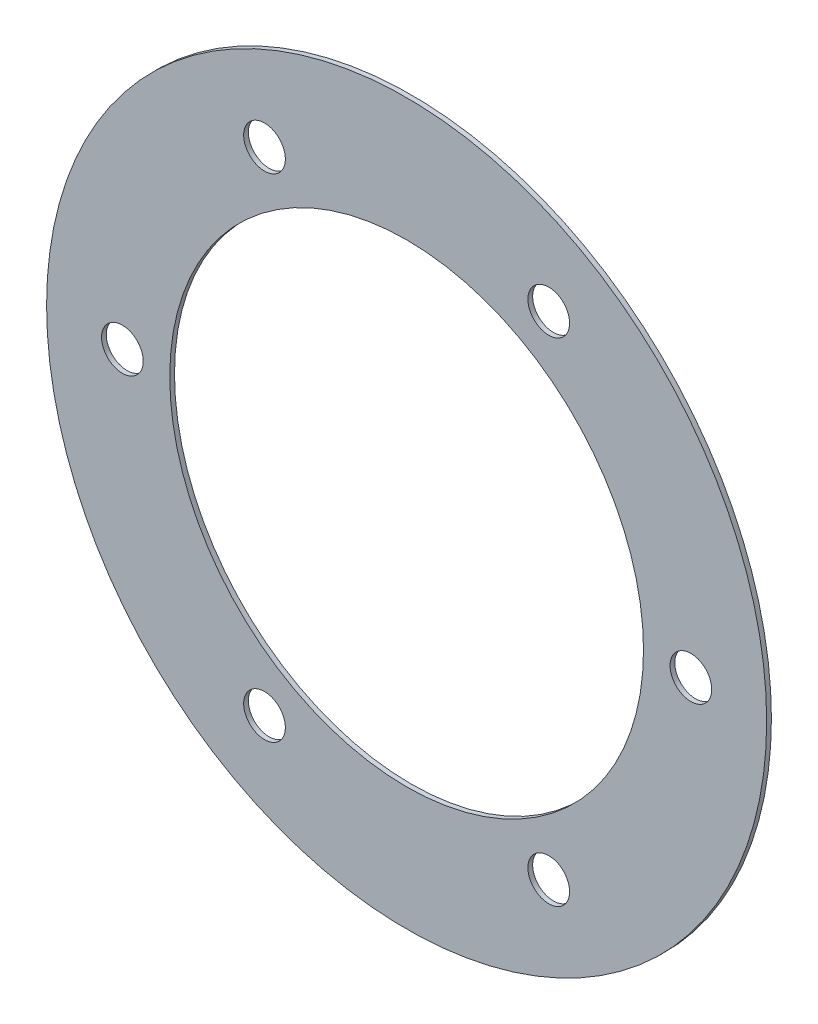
ISO-10303-21;
HEADER;
FILE_DESCRIPTION(('STEP AP214'),'2;1');
FILE_NAME('part.step','',(''),(''),'','','');
FILE_SCHEMA(('AUTOMOTIVE_DESIGN { 1 0 10303 214 1 1 1 1 }'));
ENDSEC;
DATA;
#1=APPLICATION_CONTEXT('core data for automotive mechanical design processes');
#2=APPLICATION_PROTOCOL_DEFINITION('international standard','automotive_design',2000,#1);
#3=PRODUCT_CONTEXT('',#1,'mechanical');
#4=PRODUCT('Part','Part','',(#3));
#5=PRODUCT_RELATED_PRODUCT_CATEGORY('part','',(#4));
#6=PRODUCT_DEFINITION_FORMATION('','',#4);
#7=PRODUCT_DEFINITION_CONTEXT('part definition',#1,'design');
#8=PRODUCT_DEFINITION('design','',#6,#7);
#9=PRODUCT_DEFINITION_SHAPE('','',#8);
#10=(LENGTH_UNIT() NAMED_UNIT(*) SI_UNIT(.MILLI.,.METRE.));
#11=(NAMED_UNIT(*) PLANE_ANGLE_UNIT() SI_UNIT($,.RADIAN.));
#12=(NAMED_UNIT(*) SI_UNIT($,.STERADIAN.) SOLID_ANGLE_UNIT());
#13=UNCERTAINTY_MEASURE_WITH_UNIT(LENGTH_MEASURE(1.E-05),#10,'distance_accuracy_value','');
#14=(GEOMETRIC_REPRESENTATION_CONTEXT(3) GLOBAL_UNCERTAINTY_ASSIGNED_CONTEXT((#13)) GLOBAL_UNIT_ASSIGNED_CONTEXT((#10,
#11,#12)) REPRESENTATION_CONTEXT('',''));
#15=CARTESIAN_POINT('',(0.,0.,0.));
#16=DIRECTION('',(0.,0.,1.));
#17=DIRECTION('',(1.,0.,0.));
#18=AXIS2_PLACEMENT_3D('',#15,#16,#17);
#19=CARTESIAN_POINT('',(0.,0.,0.5));
#20=DIRECTION('',(0.,0.,1.));
#21=DIRECTION('',(1.,0.,0.));
#22=AXIS2_PLACEMENT_3D('',#19,#20,#21);
#23=PLANE('',#22);
#24=CARTESIAN_POINT('',(15.0000000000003,25.980762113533,0.5));
#25=DIRECTION('',(0.,0.,1.));
#26=DIRECTION('',(1.,0.,0.));
#27=AXIS2_PLACEMENT_3D('',#24,#25,#26);
#28=CIRCLE('',#27,2.2);
#29=CARTESIAN_POINT('',(17.2000000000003,25.980762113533,0.5));
#30=VERTEX_POINT('',#29);
#31=EDGE_CURVE('E84',#30,#30,#28,.T.);
#32=ORIENTED_EDGE('',*,*,#31,.F.);
#33=EDGE_LOOP('',(#32));
#34=FACE_BOUND('',#33,.T.);
#35=CARTESIAN_POINT('',(-14.9999999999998,25.9807621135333,0.5));
#36=DIRECTION('',(0.,0.,1.));
#37=DIRECTION('',(1.,0.,0.));
#38=AXIS2_PLACEMENT_3D('',#35,#36,#37);
#39=CIRCLE('',#38,2.2);
#40=CARTESIAN_POINT('',(-12.7999999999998,25.9807621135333,0.5));
#41=VERTEX_POINT('',#40);
#42=EDGE_CURVE('E78',#41,#41,#39,.T.);
#43=ORIENTED_EDGE('',*,*,#42,.F.);
#44=EDGE_LOOP('',(#43));
#45=FACE_BOUND('',#44,.T.);
#46=CARTESIAN_POINT('',(-30.,2.09489001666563E-13,0.5));
#47=DIRECTION('',(0.,0.,1.));
#48=DIRECTION('',(1.,0.,0.));
#49=AXIS2_PLACEMENT_3D('',#46,#47,#48);
#50=CIRCLE('',#49,2.2);
#51=CARTESIAN_POINT('',(-27.8,2.09489001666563E-13,0.5));
#52=VERTEX_POINT('',#51);
#53=EDGE_CURVE('E72',#52,#52,#50,.T.);
#54=ORIENTED_EDGE('',*,*,#53,.F.);
#55=EDGE_LOOP('',(#54));
#56=FACE_BOUND('',#55,.T.);
#57=CARTESIAN_POINT('',(-15.0000000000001,-25.9807621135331,0.5));
#58=DIRECTION('',(0.,0.,1.));
#59=DIRECTION('',(1.,0.,0.));
#60=AXIS2_PLACEMENT_3D('',#57,#58,#59);
#61=CIRCLE('',#60,2.2);
#62=CARTESIAN_POINT('',(-12.8000000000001,-25.9807621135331,0.5));
#63=VERTEX_POINT('',#62);
#64=EDGE_CURVE('E66',#63,#63,#61,.T.);
#65=ORIENTED_EDGE('',*,*,#64,.F.);
#66=EDGE_LOOP('',(#65));
#67=FACE_BOUND('',#66,.T.);
#68=CARTESIAN_POINT('',(14.9999999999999,-25.9807621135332,0.5));
#69=DIRECTION('',(0.,0.,1.));
#70=DIRECTION('',(1.,0.,0.));
#71=AXIS2_PLACEMENT_3D('',#68,#69,#70);
#72=CIRCLE('',#71,2.2);
#73=CARTESIAN_POINT('',(17.1999999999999,-25.9807621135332,0.5));
#74=VERTEX_POINT('',#73);
#75=EDGE_CURVE('E60',#74,#74,#72,.T.);
#76=ORIENTED_EDGE('',*,*,#75,.F.);
#77=EDGE_LOOP('',(#76));
#78=FACE_BOUND('',#77,.T.);
#79=CARTESIAN_POINT('',(30.,0.,0.5));
#80=DIRECTION('',(0.,0.,1.));
#81=DIRECTION('',(1.,0.,0.));
#82=AXIS2_PLACEMENT_3D('',#79,#80,#81);
#83=CIRCLE('',#82,2.2);
#84=CARTESIAN_POINT('',(32.2,0.,0.5));
#85=VERTEX_POINT('',#84);
#86=EDGE_CURVE('E54',#85,#85,#83,.T.);
#87=ORIENTED_EDGE('',*,*,#86,.F.);
#88=EDGE_LOOP('',(#87));
#89=FACE_BOUND('',#88,.T.);
#90=CARTESIAN_POINT('',(0.,0.,0.5));
#91=DIRECTION('',(0.,0.,1.));
#92=DIRECTION('',(1.,0.,0.));
#93=AXIS2_PLACEMENT_3D('',#90,#91,#92);
#94=CIRCLE('',#93,38.);
#95=CARTESIAN_POINT('',(38.,0.,0.5));
#96=VERTEX_POINT('',#95);
#97=EDGE_CURVE('E10',#96,#96,#94,.T.);
#98=ORIENTED_EDGE('',*,*,#97,.T.);
#99=EDGE_LOOP('',(#98));
#100=FACE_BOUND('',#99,.T.);
#101=CARTESIAN_POINT('',(0.,0.,0.5));
#102=DIRECTION('',(0.,0.,1.));
#103=DIRECTION('',(1.,0.,0.));
#104=AXIS2_PLACEMENT_3D('',#101,#102,#103);
#105=CIRCLE('',#104,25.);
#106=CARTESIAN_POINT('',(25.,0.,0.5));
#107=VERTEX_POINT('',#106);
#108=EDGE_CURVE('E42',#107,#107,#105,.T.);
#109=ORIENTED_EDGE('',*,*,#108,.F.);
#110=EDGE_LOOP('',(#109));
#111=FACE_BOUND('',#110,.T.);
#112=ADVANCED_FACE('F31',(#34,#45,#56,#67,#78,#89,#100,#111),#23,.T.);
#113=CARTESIAN_POINT('',(0.,0.,0.));
#114=DIRECTION('',(0.,0.,1.));
#115=DIRECTION('',(1.,0.,0.));
#116=AXIS2_PLACEMENT_3D('',#113,#114,#115);
#117=PLANE('',#116);
#118=CARTESIAN_POINT('',(15.0000000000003,25.980762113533,0.));
#119=DIRECTION('',(0.,0.,1.));
#120=DIRECTION('',(1.,0.,0.));
#121=AXIS2_PLACEMENT_3D('',#118,#119,#120);
#122=CIRCLE('',#121,2.2);
#123=CARTESIAN_POINT('',(17.2000000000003,25.980762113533,0.));
#124=VERTEX_POINT('',#123);
#125=EDGE_CURVE('E81',#124,#124,#122,.T.);
#126=ORIENTED_EDGE('',*,*,#125,.T.);
#127=EDGE_LOOP('',(#126));
#128=FACE_BOUND('',#127,.T.);
#129=CARTESIAN_POINT('',(-14.9999999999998,25.9807621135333,0.));
#130=DIRECTION('',(0.,0.,1.));
#131=DIRECTION('',(1.,0.,0.));
#132=AXIS2_PLACEMENT_3D('',#129,#130,#131);
#133=CIRCLE('',#132,2.2);
#134=CARTESIAN_POINT('',(-12.7999999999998,25.9807621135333,0.));
#135=VERTEX_POINT('',#134);
#136=EDGE_CURVE('E75',#135,#135,#133,.T.);
#137=ORIENTED_EDGE('',*,*,#136,.T.);
#138=EDGE_LOOP('',(#137));
#139=FACE_BOUND('',#138,.T.);
#140=CARTESIAN_POINT('',(-30.,2.09489001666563E-13,0.));
#141=DIRECTION('',(0.,0.,1.));
#142=DIRECTION('',(1.,0.,0.));
#143=AXIS2_PLACEMENT_3D('',#140,#141,#142);
#144=CIRCLE('',#143,2.2);
#145=CARTESIAN_POINT('',(-27.8,2.09489001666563E-13,0.));
#146=VERTEX_POINT('',#145);
#147=EDGE_CURVE('E69',#146,#146,#144,.T.);
#148=ORIENTED_EDGE('',*,*,#147,.T.);
#149=EDGE_LOOP('',(#148));
#150=FACE_BOUND('',#149,.T.);
#151=CARTESIAN_POINT('',(-15.0000000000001,-25.9807621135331,0.));
#152=DIRECTION('',(0.,0.,1.));
#153=DIRECTION('',(1.,0.,0.));
#154=AXIS2_PLACEMENT_3D('',#151,#152,#153);
#155=CIRCLE('',#154,2.2);
#156=CARTESIAN_POINT('',(-12.8000000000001,-25.9807621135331,0.));
#157=VERTEX_POINT('',#156);
#158=EDGE_CURVE('E63',#157,#157,#155,.T.);
#159=ORIENTED_EDGE('',*,*,#158,.T.);
#160=EDGE_LOOP('',(#159));
#161=FACE_BOUND('',#160,.T.);
#162=CARTESIAN_POINT('',(14.9999999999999,-25.9807621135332,0.));
#163=DIRECTION('',(0.,0.,1.));
#164=DIRECTION('',(1.,0.,0.));
#165=AXIS2_PLACEMENT_3D('',#162,#163,#164);
#166=CIRCLE('',#165,2.2);
#167=CARTESIAN_POINT('',(17.1999999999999,-25.9807621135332,0.));
#168=VERTEX_POINT('',#167);
#169=EDGE_CURVE('E57',#168,#168,#166,.T.);
#170=ORIENTED_EDGE('',*,*,#169,.T.);
#171=EDGE_LOOP('',(#170));
#172=FACE_BOUND('',#171,.T.);
#173=CARTESIAN_POINT('',(30.,0.,0.));
#174=DIRECTION('',(0.,0.,1.));
#175=DIRECTION('',(1.,0.,0.));
#176=AXIS2_PLACEMENT_3D('',#173,#174,#175);
#177=CIRCLE('',#176,2.2);
#178=CARTESIAN_POINT('',(32.2,0.,0.));
#179=VERTEX_POINT('',#178);
#180=EDGE_CURVE('E51',#179,#179,#177,.T.);
#181=ORIENTED_EDGE('',*,*,#180,.T.);
#182=EDGE_LOOP('',(#181));
#183=FACE_BOUND('',#182,.T.);
#184=CARTESIAN_POINT('',(0.,0.,0.));
#185=DIRECTION('',(0.,0.,1.));
#186=DIRECTION('',(1.,0.,0.));
#187=AXIS2_PLACEMENT_3D('',#184,#185,#186);
#188=CIRCLE('',#187,38.);
#189=CARTESIAN_POINT('',(38.,0.,0.));
#190=VERTEX_POINT('',#189);
#191=EDGE_CURVE('E38',#190,#190,#188,.T.);
#192=ORIENTED_EDGE('',*,*,#191,.F.);
#193=EDGE_LOOP('',(#192));
#194=FACE_BOUND('',#193,.T.);
#195=CARTESIAN_POINT('',(0.,0.,0.));
#196=DIRECTION('',(0.,0.,1.));
#197=DIRECTION('',(1.,0.,0.));
#198=AXIS2_PLACEMENT_3D('',#195,#196,#197);
#199=CIRCLE('',#198,25.);
#200=CARTESIAN_POINT('',(25.,0.,0.));
#201=VERTEX_POINT('',#200);
#202=EDGE_CURVE('E46',#201,#201,#199,.T.);
#203=ORIENTED_EDGE('',*,*,#202,.T.);
#204=EDGE_LOOP('',(#203));
#205=FACE_BOUND('',#204,.T.);
#206=ADVANCED_FACE('F92',(#128,#139,#150,#161,#172,#183,#194,#205),#117,.F.);
#207=CARTESIAN_POINT('',(0.,0.,0.5));
#208=DIRECTION('',(0.,0.,-1.));
#209=DIRECTION('',(-1.,0.,0.));
#210=AXIS2_PLACEMENT_3D('',#207,#208,#209);
#211=CYLINDRICAL_SURFACE('',#210,38.);
#212=ORIENTED_EDGE('',*,*,#97,.F.);
#213=EDGE_LOOP('',(#212));
#214=FACE_BOUND('',#213,.T.);
#215=ORIENTED_EDGE('',*,*,#191,.T.);
#216=EDGE_LOOP('',(#215));
#217=FACE_BOUND('',#216,.T.);
#218=ADVANCED_FACE('F33',(#214,#217),#211,.T.);
#219=CARTESIAN_POINT('',(0.,0.,0.5));
#220=DIRECTION('',(0.,0.,-1.));
#221=DIRECTION('',(-1.,0.,0.));
#222=AXIS2_PLACEMENT_3D('',#219,#220,#221);
#223=CYLINDRICAL_SURFACE('',#222,25.);
#224=ORIENTED_EDGE('',*,*,#108,.T.);
#225=EDGE_LOOP('',(#224));
#226=FACE_BOUND('',#225,.T.);
#227=ORIENTED_EDGE('',*,*,#202,.F.);
#228=EDGE_LOOP('',(#227));
#229=FACE_BOUND('',#228,.T.);
#230=ADVANCED_FACE('F105',(#226,#229),#223,.F.);
#231=CARTESIAN_POINT('',(30.,0.,0.5));
#232=DIRECTION('',(0.,0.,1.));
#233=DIRECTION('',(1.,0.,0.));
#234=AXIS2_PLACEMENT_3D('',#231,#232,#233);
#235=CYLINDRICAL_SURFACE('',#234,2.2);
#236=ORIENTED_EDGE('',*,*,#180,.F.);
#237=EDGE_LOOP('',(#236));
#238=FACE_BOUND('',#237,.T.);
#239=ORIENTED_EDGE('',*,*,#86,.T.);
#240=EDGE_LOOP('',(#239));
#241=FACE_BOUND('',#240,.T.);
#242=ADVANCED_FACE('F108',(#238,#241),#235,.F.);
#243=CARTESIAN_POINT('',(14.9999999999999,-25.9807621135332,0.5));
#244=DIRECTION('',(0.,0.,1.));
#245=DIRECTION('',(1.,0.,0.));
#246=AXIS2_PLACEMENT_3D('',#243,#244,#245);
#247=CYLINDRICAL_SURFACE('',#246,2.2);
#248=ORIENTED_EDGE('',*,*,#169,.F.);
#249=EDGE_LOOP('',(#248));
#250=FACE_BOUND('',#249,.T.);
#251=ORIENTED_EDGE('',*,*,#75,.T.);
#252=EDGE_LOOP('',(#251));
#253=FACE_BOUND('',#252,.T.);
#254=ADVANCED_FACE('F123',(#250,#253),#247,.F.);
#255=CARTESIAN_POINT('',(-15.0000000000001,-25.9807621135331,0.5));
#256=DIRECTION('',(0.,0.,1.));
#257=DIRECTION('',(1.,0.,0.));
#258=AXIS2_PLACEMENT_3D('',#255,#256,#257);
#259=CYLINDRICAL_SURFACE('',#258,2.2);
#260=ORIENTED_EDGE('',*,*,#158,.F.);
#261=EDGE_LOOP('',(#260));
#262=FACE_BOUND('',#261,.T.);
#263=ORIENTED_EDGE('',*,*,#64,.T.);
#264=EDGE_LOOP('',(#263));
#265=FACE_BOUND('',#264,.T.);
#266=ADVANCED_FACE('F127',(#262,#265),#259,.F.);
#267=CARTESIAN_POINT('',(-30.,2.09489001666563E-13,0.5));
#268=DIRECTION('',(0.,0.,1.));
#269=DIRECTION('',(1.,0.,0.));
#270=AXIS2_PLACEMENT_3D('',#267,#268,#269);
#271=CYLINDRICAL_SURFACE('',#270,2.2);
#272=ORIENTED_EDGE('',*,*,#147,.F.);
#273=EDGE_LOOP('',(#272));
#274=FACE_BOUND('',#273,.T.);
#275=ORIENTED_EDGE('',*,*,#53,.T.);
#276=EDGE_LOOP('',(#275));
#277=FACE_BOUND('',#276,.T.);
#278=ADVANCED_FACE('F131',(#274,#277),#271,.F.);
#279=CARTESIAN_POINT('',(-14.9999999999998,25.9807621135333,0.5));
#280=DIRECTION('',(0.,0.,1.));
#281=DIRECTION('',(1.,0.,0.));
#282=AXIS2_PLACEMENT_3D('',#279,#280,#281);
#283=CYLINDRICAL_SURFACE('',#282,2.2);
#284=ORIENTED_EDGE('',*,*,#136,.F.);
#285=EDGE_LOOP('',(#284));
#286=FACE_BOUND('',#285,.T.);
#287=ORIENTED_EDGE('',*,*,#42,.T.);
#288=EDGE_LOOP('',(#287));
#289=FACE_BOUND('',#288,.T.);
#290=ADVANCED_FACE('F135',(#286,#289),#283,.F.);
#291=CARTESIAN_POINT('',(15.0000000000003,25.980762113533,0.5));
#292=DIRECTION('',(0.,0.,1.));
#293=DIRECTION('',(1.,0.,0.));
#294=AXIS2_PLACEMENT_3D('',#291,#292,#293);
#295=CYLINDRICAL_SURFACE('',#294,2.2);
#296=ORIENTED_EDGE('',*,*,#125,.F.);
#297=EDGE_LOOP('',(#296));
#298=FACE_BOUND('',#297,.T.);
#299=ORIENTED_EDGE('',*,*,#31,.T.);
#300=EDGE_LOOP('',(#299));
#301=FACE_BOUND('',#300,.T.);
#302=ADVANCED_FACE('F88',(#298,#301),#295,.F.);
#303=CLOSED_SHELL('',(#112,#206,#218,#230,#242,#254,#266,#278,#290,#302));
#304=MANIFOLD_SOLID_BREP('B2',#303);
#305=ADVANCED_BREP_SHAPE_REPRESENTATION('',(#18,#304),#14);
#306=SHAPE_DEFINITION_REPRESENTATION(#9,#305);
ENDSEC;
END-ISO-10303-21;
